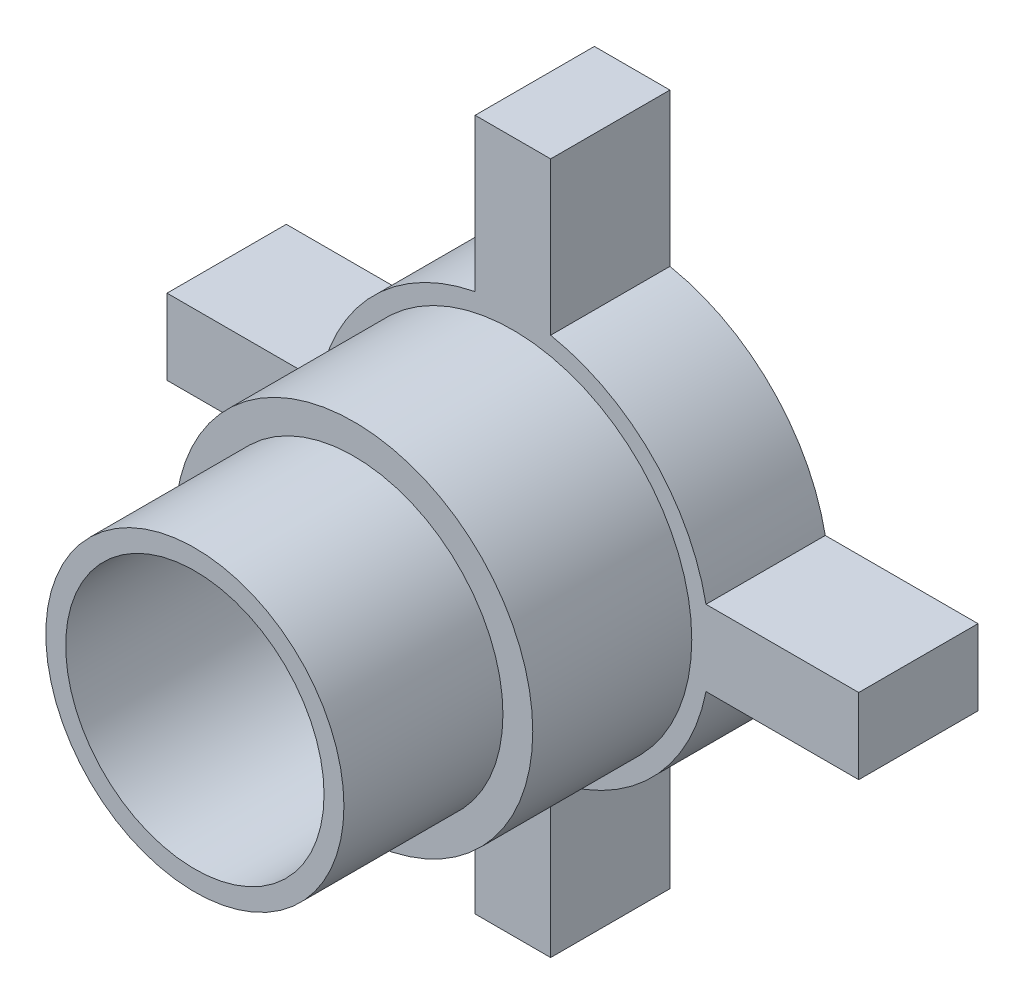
from build123d import *

# Parameters (mm, degrees)
EXTRUDE_1_DEPTH     = 6
SKETCH_2_R          = 9
EXTRUDE_2_DEPTH     = 8
SKETCH_3_R          = 7.5
EXTRUDE_3_DEPTH     = 8
SKETCH_4_R          = 6.5
CUT_EXTRUDE_1_DEPTH = 34.007877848


with BuildPart() as part:
    # Sketch 1 → Extrude 1 (new body)
    with BuildSketch(Plane.XY):
        with BuildLine():
            Line((-1.9, 9.715966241), (-1.9, 17.4))
            Line((-1.9, 17.4), (1.9, 17.4))
            Line((1.9, 17.4), (1.9, 9.715966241))
            ThreePointArc((1.9, 9.715966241), (7.000357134, 7.000357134), (9.715966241, 1.9))
            Line((9.715966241, 1.9), (17.4, 1.9))
            Line((17.4, 1.9), (17.4, -1.9))
            Line((17.4, -1.9), (9.715966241, -1.9))
            ThreePointArc((9.715966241, -1.9), (7.000357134, -7.000357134), (1.9, -9.715966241))
            Line((1.9, -9.715966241), (1.9, -17.4))
            Line((1.9, -17.4), (-1.9, -17.4))
            Line((-1.9, -17.4), (-1.9, -9.715966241))
            ThreePointArc((-1.9, -9.715966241), (-7.000357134, -7.000357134), (-9.715966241, -1.9))
            Line((-9.715966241, -1.9), (-17.4, -1.9))
            Line((-17.4, -1.9), (-17.4, 1.9))
            Line((-17.4, 1.9), (-9.715966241, 1.9))
            ThreePointArc((-9.715966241, 1.9), (-7.000357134, 7.000357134), (-1.9, 9.715966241))
        make_face()
    extrude(amount=EXTRUDE_1_DEPTH)

    # Sketch 2 → Extrude 2 (add)
    with BuildSketch(Plane.XY.offset(6)):
        Circle(SKETCH_2_R)
    extrude(amount=EXTRUDE_2_DEPTH)

    # Sketch 3 → Extrude 3 (add)
    with BuildSketch(Plane.XY.offset(14)):
        Circle(SKETCH_3_R)
    extrude(amount=EXTRUDE_3_DEPTH)

    # Sketch 4 → Cut-Extrude 1 (cut, through all)
    with BuildSketch(Plane.XY.offset(22)):
        Circle(SKETCH_4_R)
    extrude(amount=-CUT_EXTRUDE_1_DEPTH, mode=Mode.SUBTRACT)


solid = part.part
